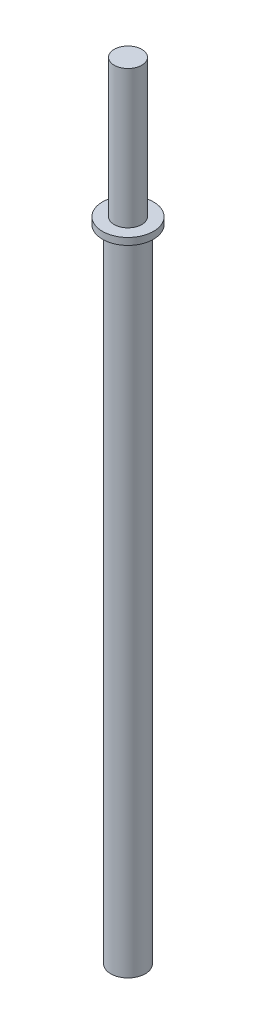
ISO-10303-21;
HEADER;
FILE_DESCRIPTION(('STEP AP214'),'2;1');
FILE_NAME('part.step','',(''),(''),'','','');
FILE_SCHEMA(('AUTOMOTIVE_DESIGN { 1 0 10303 214 1 1 1 1 }'));
ENDSEC;
DATA;
#1=APPLICATION_CONTEXT('core data for automotive mechanical design processes');
#2=APPLICATION_PROTOCOL_DEFINITION('international standard','automotive_design',2000,#1);
#3=PRODUCT_CONTEXT('',#1,'mechanical');
#4=PRODUCT('Part','Part','',(#3));
#5=PRODUCT_RELATED_PRODUCT_CATEGORY('part','',(#4));
#6=PRODUCT_DEFINITION_FORMATION('','',#4);
#7=PRODUCT_DEFINITION_CONTEXT('part definition',#1,'design');
#8=PRODUCT_DEFINITION('design','',#6,#7);
#9=PRODUCT_DEFINITION_SHAPE('','',#8);
#10=(LENGTH_UNIT() NAMED_UNIT(*) SI_UNIT(.MILLI.,.METRE.));
#11=(NAMED_UNIT(*) PLANE_ANGLE_UNIT() SI_UNIT($,.RADIAN.));
#12=(NAMED_UNIT(*) SI_UNIT($,.STERADIAN.) SOLID_ANGLE_UNIT());
#13=UNCERTAINTY_MEASURE_WITH_UNIT(LENGTH_MEASURE(1.E-05),#10,'distance_accuracy_value','');
#14=(GEOMETRIC_REPRESENTATION_CONTEXT(3) GLOBAL_UNCERTAINTY_ASSIGNED_CONTEXT((#13)) GLOBAL_UNIT_ASSIGNED_CONTEXT((#10,
#11,#12)) REPRESENTATION_CONTEXT('',''));
#15=CARTESIAN_POINT('',(0.,0.,0.));
#16=DIRECTION('',(0.,0.,1.));
#17=DIRECTION('',(1.,0.,0.));
#18=AXIS2_PLACEMENT_3D('',#15,#16,#17);
#19=CARTESIAN_POINT('',(0.,84.5018798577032,0.));
#20=DIRECTION('',(0.,1.,0.));
#21=DIRECTION('',(-1.,0.,0.));
#22=AXIS2_PLACEMENT_3D('',#19,#20,#21);
#23=PLANE('',#22);
#24=CARTESIAN_POINT('',(0.,84.5018798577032,0.));
#25=DIRECTION('',(0.,1.,0.));
#26=DIRECTION('',(-1.,0.,0.));
#27=AXIS2_PLACEMENT_3D('',#24,#25,#26);
#28=CIRCLE('',#27,2.);
#29=CARTESIAN_POINT('',(-2.,84.5018798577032,0.));
#30=VERTEX_POINT('',#29);
#31=EDGE_CURVE('E10',#30,#30,#28,.T.);
#32=ORIENTED_EDGE('',*,*,#31,.T.);
#33=EDGE_LOOP('',(#32));
#34=FACE_BOUND('',#33,.T.);
#35=ADVANCED_FACE('F37',(#34),#23,.T.);
#36=CARTESIAN_POINT('',(0.,84.5018798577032,0.));
#37=DIRECTION('',(0.,1.,0.));
#38=DIRECTION('',(-1.,0.,0.));
#39=AXIS2_PLACEMENT_3D('',#36,#37,#38);
#40=CYLINDRICAL_SURFACE('',#39,2.);
#41=CARTESIAN_POINT('',(0.,64.5018798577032,0.));
#42=DIRECTION('',(0.,1.,0.));
#43=DIRECTION('',(-1.,0.,0.));
#44=AXIS2_PLACEMENT_3D('',#41,#42,#43);
#45=CIRCLE('',#44,2.);
#46=CARTESIAN_POINT('',(-2.,64.5018798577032,0.));
#47=VERTEX_POINT('',#46);
#48=EDGE_CURVE('E44',#47,#47,#45,.T.);
#49=ORIENTED_EDGE('',*,*,#48,.T.);
#50=EDGE_LOOP('',(#49));
#51=FACE_BOUND('',#50,.T.);
#52=ORIENTED_EDGE('',*,*,#31,.F.);
#53=EDGE_LOOP('',(#52));
#54=FACE_BOUND('',#53,.T.);
#55=ADVANCED_FACE('F81',(#51,#54),#40,.T.);
#56=CARTESIAN_POINT('',(-2.,64.5018798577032,0.));
#57=DIRECTION('',(0.,1.,0.));
#58=DIRECTION('',(-1.,0.,0.));
#59=AXIS2_PLACEMENT_3D('',#56,#57,#58);
#60=PLANE('',#59);
#61=CARTESIAN_POINT('',(0.,64.5018798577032,0.));
#62=DIRECTION('',(0.,1.,0.));
#63=DIRECTION('',(-1.,0.,0.));
#64=AXIS2_PLACEMENT_3D('',#61,#62,#63);
#65=CIRCLE('',#64,3.7);
#66=CARTESIAN_POINT('',(-3.7,64.5018798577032,0.));
#67=VERTEX_POINT('',#66);
#68=EDGE_CURVE('E49',#67,#67,#65,.T.);
#69=ORIENTED_EDGE('',*,*,#68,.T.);
#70=EDGE_LOOP('',(#69));
#71=FACE_BOUND('',#70,.T.);
#72=ORIENTED_EDGE('',*,*,#48,.F.);
#73=EDGE_LOOP('',(#72));
#74=FACE_BOUND('',#73,.T.);
#75=ADVANCED_FACE('F85',(#71,#74),#60,.T.);
#76=CARTESIAN_POINT('',(0.,84.5018798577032,0.));
#77=DIRECTION('',(0.,1.,0.));
#78=DIRECTION('',(-1.,0.,0.));
#79=AXIS2_PLACEMENT_3D('',#76,#77,#78);
#80=CYLINDRICAL_SURFACE('',#79,3.7);
#81=CARTESIAN_POINT('',(0.,63.5018798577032,0.));
#82=DIRECTION('',(0.,1.,0.));
#83=DIRECTION('',(-1.,0.,0.));
#84=AXIS2_PLACEMENT_3D('',#81,#82,#83);
#85=CIRCLE('',#84,3.7);
#86=CARTESIAN_POINT('',(-3.7,63.5018798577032,0.));
#87=VERTEX_POINT('',#86);
#88=EDGE_CURVE('E54',#87,#87,#85,.T.);
#89=ORIENTED_EDGE('',*,*,#88,.T.);
#90=EDGE_LOOP('',(#89));
#91=FACE_BOUND('',#90,.T.);
#92=ORIENTED_EDGE('',*,*,#68,.F.);
#93=EDGE_LOOP('',(#92));
#94=FACE_BOUND('',#93,.T.);
#95=ADVANCED_FACE('F89',(#91,#94),#80,.T.);
#96=CARTESIAN_POINT('',(-3.7,63.5018798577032,0.));
#97=DIRECTION('',(0.,-1.,0.));
#98=DIRECTION('',(1.,0.,0.));
#99=AXIS2_PLACEMENT_3D('',#96,#97,#98);
#100=PLANE('',#99);
#101=CARTESIAN_POINT('',(0.,63.5018798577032,0.));
#102=DIRECTION('',(0.,1.,0.));
#103=DIRECTION('',(-1.,0.,0.));
#104=AXIS2_PLACEMENT_3D('',#101,#102,#103);
#105=CIRCLE('',#104,2.5);
#106=CARTESIAN_POINT('',(-2.5,63.5018798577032,0.));
#107=VERTEX_POINT('',#106);
#108=EDGE_CURVE('E60',#107,#107,#105,.T.);
#109=ORIENTED_EDGE('',*,*,#108,.T.);
#110=EDGE_LOOP('',(#109));
#111=FACE_BOUND('',#110,.T.);
#112=ORIENTED_EDGE('',*,*,#88,.F.);
#113=EDGE_LOOP('',(#112));
#114=FACE_BOUND('',#113,.T.);
#115=ADVANCED_FACE('F78',(#111,#114),#100,.T.);
#116=CARTESIAN_POINT('',(0.,84.5018798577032,0.));
#117=DIRECTION('',(0.,1.,0.));
#118=DIRECTION('',(-1.,0.,0.));
#119=AXIS2_PLACEMENT_3D('',#116,#117,#118);
#120=CYLINDRICAL_SURFACE('',#119,2.5);
#121=CARTESIAN_POINT('',(0.,-29.2898150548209,0.));
#122=DIRECTION('',(0.,1.,0.));
#123=DIRECTION('',(-1.,0.,0.));
#124=AXIS2_PLACEMENT_3D('',#121,#122,#123);
#125=CIRCLE('',#124,2.5);
#126=CARTESIAN_POINT('',(-2.49999999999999,-29.2898150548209,0.));
#127=VERTEX_POINT('',#126);
#128=EDGE_CURVE('E64',#127,#127,#125,.T.);
#129=ORIENTED_EDGE('',*,*,#128,.T.);
#130=EDGE_LOOP('',(#129));
#131=FACE_BOUND('',#130,.T.);
#132=ORIENTED_EDGE('',*,*,#108,.F.);
#133=EDGE_LOOP('',(#132));
#134=FACE_BOUND('',#133,.T.);
#135=ADVANCED_FACE('F69',(#131,#134),#120,.T.);
#136=CARTESIAN_POINT('',(-2.49999999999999,-29.2898150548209,0.));
#137=DIRECTION('',(0.,-1.,0.));
#138=DIRECTION('',(1.,0.,0.));
#139=AXIS2_PLACEMENT_3D('',#136,#137,#138);
#140=PLANE('',#139);
#141=ORIENTED_EDGE('',*,*,#128,.F.);
#142=EDGE_LOOP('',(#141));
#143=FACE_BOUND('',#142,.T.);
#144=ADVANCED_FACE('F72',(#143),#140,.T.);
#145=CLOSED_SHELL('',(#35,#55,#75,#95,#115,#135,#144));
#146=MANIFOLD_SOLID_BREP('B2',#145);
#147=ADVANCED_BREP_SHAPE_REPRESENTATION('',(#18,#146),#14);
#148=SHAPE_DEFINITION_REPRESENTATION(#9,#147);
ENDSEC;
END-ISO-10303-21;
